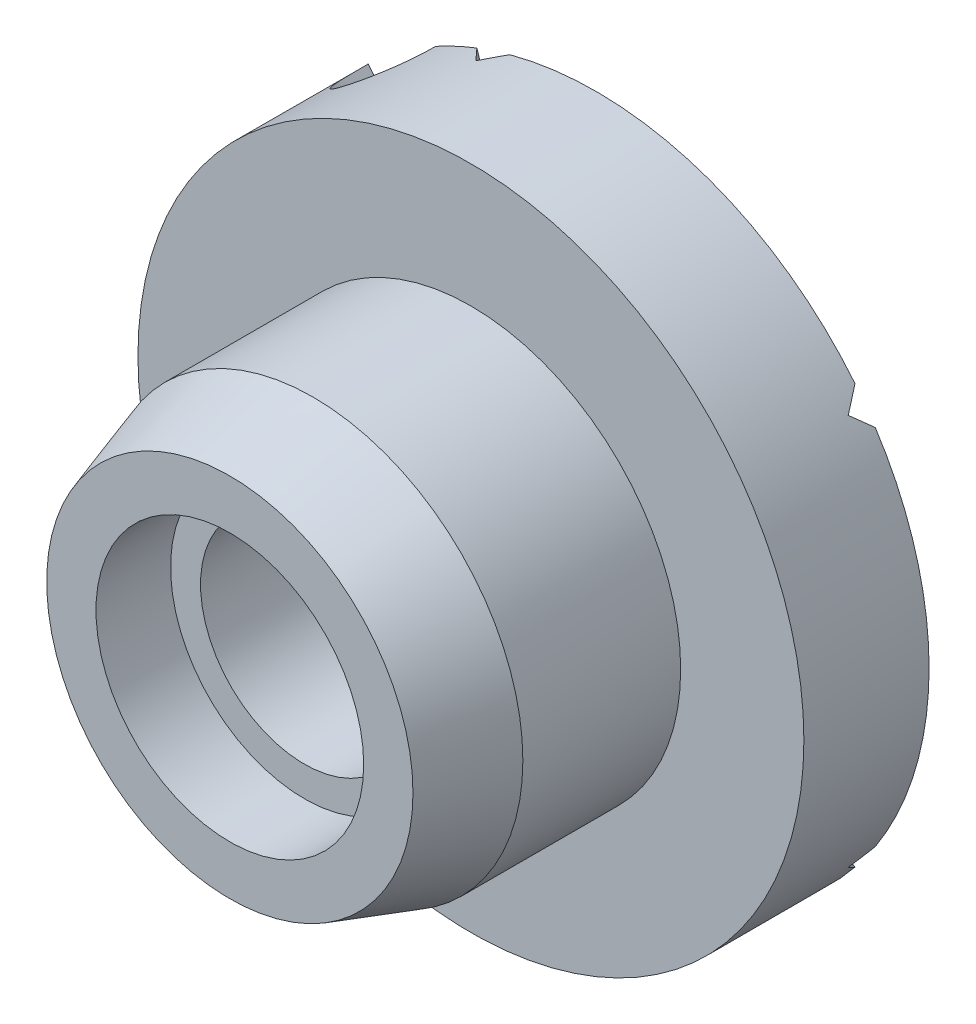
ISO-10303-21;
HEADER;
FILE_DESCRIPTION(('STEP AP214'),'2;1');
FILE_NAME('part.step','',(''),(''),'','','');
FILE_SCHEMA(('AUTOMOTIVE_DESIGN { 1 0 10303 214 1 1 1 1 }'));
ENDSEC;
DATA;
#1=APPLICATION_CONTEXT('core data for automotive mechanical design processes');
#2=APPLICATION_PROTOCOL_DEFINITION('international standard','automotive_design',2000,#1);
#3=PRODUCT_CONTEXT('',#1,'mechanical');
#4=PRODUCT('Part','Part','',(#3));
#5=PRODUCT_RELATED_PRODUCT_CATEGORY('part','',(#4));
#6=PRODUCT_DEFINITION_FORMATION('','',#4);
#7=PRODUCT_DEFINITION_CONTEXT('part definition',#1,'design');
#8=PRODUCT_DEFINITION('design','',#6,#7);
#9=PRODUCT_DEFINITION_SHAPE('','',#8);
#10=(LENGTH_UNIT() NAMED_UNIT(*) SI_UNIT(.MILLI.,.METRE.));
#11=(NAMED_UNIT(*) PLANE_ANGLE_UNIT() SI_UNIT($,.RADIAN.));
#12=(NAMED_UNIT(*) SI_UNIT($,.STERADIAN.) SOLID_ANGLE_UNIT());
#13=UNCERTAINTY_MEASURE_WITH_UNIT(LENGTH_MEASURE(1.E-05),#10,'distance_accuracy_value','');
#14=(GEOMETRIC_REPRESENTATION_CONTEXT(3) GLOBAL_UNCERTAINTY_ASSIGNED_CONTEXT((#13)) GLOBAL_UNIT_ASSIGNED_CONTEXT((#10,
#11,#12)) REPRESENTATION_CONTEXT('',''));
#15=CARTESIAN_POINT('',(0.,0.,0.));
#16=DIRECTION('',(0.,0.,1.));
#17=DIRECTION('',(1.,0.,0.));
#18=AXIS2_PLACEMENT_3D('',#15,#16,#17);
#19=CARTESIAN_POINT('',(0.,0.,0.));
#20=DIRECTION('',(0.,0.,1.));
#21=DIRECTION('',(1.,0.,0.));
#22=AXIS2_PLACEMENT_3D('',#19,#20,#21);
#23=CYLINDRICAL_SURFACE('',#22,6.35);
#24=CARTESIAN_POINT('',(0.,0.,-4.5974));
#25=DIRECTION('',(0.,0.,1.));
#26=DIRECTION('',(1.,0.,0.));
#27=AXIS2_PLACEMENT_3D('',#24,#25,#26);
#28=CIRCLE('',#27,6.35);
#29=CARTESIAN_POINT('',(6.35,0.,-4.5974));
#30=VERTEX_POINT('',#29);
#31=EDGE_CURVE('E172',#30,#30,#28,.T.);
#32=ORIENTED_EDGE('',*,*,#31,.F.);
#33=EDGE_LOOP('',(#32));
#34=FACE_BOUND('',#33,.T.);
#35=CARTESIAN_POINT('',(-4.34524158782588,4.63048329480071,-6.985));
#36=CARTESIAN_POINT('',(-4.34561049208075,4.63013241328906,-6.94031767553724));
#37=CARTESIAN_POINT('',(-4.34460667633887,4.63107891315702,-6.89561854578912));
#38=CARTESIAN_POINT('',(-4.33987519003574,4.63551564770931,-6.80645726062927));
#39=CARTESIAN_POINT('',(-4.33614547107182,4.63900779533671,-6.76199530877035));
#40=CARTESIAN_POINT('',(-4.32593414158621,4.64853099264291,-6.67321992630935));
#41=CARTESIAN_POINT('',(-4.31942626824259,4.65458626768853,-6.62891208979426));
#42=CARTESIAN_POINT('',(-4.30360444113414,4.66921882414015,-6.54124609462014));
#43=CARTESIAN_POINT('',(-4.29429165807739,4.67779505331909,-6.4978875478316));
#44=CARTESIAN_POINT('',(-4.26760510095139,4.70218243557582,-6.39210613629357));
#45=CARTESIAN_POINT('',(-4.24850473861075,4.719493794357,-6.33044338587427));
#46=CARTESIAN_POINT('',(-4.20330863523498,4.75979155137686,-6.21183757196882));
#47=CARTESIAN_POINT('',(-4.17723721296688,4.78275819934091,-6.15487898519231));
#48=CARTESIAN_POINT('',(-4.12698226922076,4.82609791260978,-6.06585877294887));
#49=CARTESIAN_POINT('',(-4.10499635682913,4.84484101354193,-6.03176860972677));
#50=CARTESIAN_POINT('',(-4.05707552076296,4.88503990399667,-5.96824730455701));
#51=CARTESIAN_POINT('',(-4.03114610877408,4.90649190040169,-5.93880977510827));
#52=CARTESIAN_POINT('',(-3.98164312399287,4.94669433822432,-5.89249163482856));
#53=CARTESIAN_POINT('',(-3.95890356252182,4.96492819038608,-5.87428061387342));
#54=CARTESIAN_POINT('',(-3.91113141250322,5.0026467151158,-5.84278722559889));
#55=CARTESIAN_POINT('',(-3.88610056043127,5.02213043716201,-5.82950116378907));
#56=CARTESIAN_POINT('',(-3.83394850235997,5.06205730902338,-5.80883337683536));
#57=CARTESIAN_POINT('',(-3.80680965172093,5.0825078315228,-5.80150911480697));
#58=CARTESIAN_POINT('',(-3.75157370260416,5.12341403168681,-5.79376891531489));
#59=CARTESIAN_POINT('',(-3.7234774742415,5.14386968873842,-5.79334686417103));
#60=CARTESIAN_POINT('',(-3.67153042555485,5.18104587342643,-5.79899179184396));
#61=CARTESIAN_POINT('',(-3.64765273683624,5.19787904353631,-5.80413002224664));
#62=CARTESIAN_POINT('',(-3.60067648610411,5.2305303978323,-5.81905354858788));
#63=CARTESIAN_POINT('',(-3.57757828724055,5.24634811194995,-5.82884097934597));
#64=CARTESIAN_POINT('',(-3.52613850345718,5.28110502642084,-5.85583521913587));
#65=CARTESIAN_POINT('',(-3.49821227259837,5.29962410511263,-5.87436909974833));
#66=CARTESIAN_POINT('',(-3.4449787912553,5.3343825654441,-5.91659717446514));
#67=CARTESIAN_POINT('',(-3.41967633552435,5.35061779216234,-5.94030057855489));
#68=CARTESIAN_POINT('',(-3.36167579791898,5.38732481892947,-6.00248879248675));
#69=CARTESIAN_POINT('',(-3.33041102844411,5.40666047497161,-6.04297191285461));
#70=CARTESIAN_POINT('',(-3.27337538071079,5.44138105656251,-6.12914654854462));
#71=CARTESIAN_POINT('',(-3.24761679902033,5.45675715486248,-6.17484937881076));
#72=CARTESIAN_POINT('',(-3.19092738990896,5.49017400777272,-6.2909787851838));
#73=CARTESIAN_POINT('',(-3.1628298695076,5.50633450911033,-6.36332639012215));
#74=CARTESIAN_POINT('',(-3.11679735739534,5.53251877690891,-6.5121954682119));
#75=CARTESIAN_POINT('',(-3.09887147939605,5.54253704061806,-6.58872061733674));
#76=CARTESIAN_POINT('',(-3.07715658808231,5.55461130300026,-6.7189036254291));
#77=CARTESIAN_POINT('',(-3.07067429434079,5.5581923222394,-6.77199198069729));
#78=CARTESIAN_POINT('',(-3.06239231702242,5.56275611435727,-6.87839169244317));
#79=CARTESIAN_POINT('',(-3.06057078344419,5.56375101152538,-6.93170083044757));
#80=CARTESIAN_POINT('',(-3.06109781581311,5.56346835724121,-6.985));
#81=B_SPLINE_CURVE_WITH_KNOTS('',3,(#35,#36,#37,#38,#39,#40,#41,#42,#43,#44,#45,#46,#47,#48,#49,
#50,#51,#52,#53,#54,#55,#56,#57,#58,#59,#60,#61,#62,#63,#64,#65,#66,#67,#68,#69,#70,#71,#72,#73,
#74,#75,#76,#77,#78,#79,#80),.UNSPECIFIED.,.F.,.F.,(4,2,2,2,2,2,2,2,2,2,2,2,2,2,2,2,2,2,2,2,2,2,
4),(0.,0.134008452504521,0.268117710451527,0.403523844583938,0.53887354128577,0.738714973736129,
0.937868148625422,1.07154257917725,1.20503186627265,1.3077602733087,1.41041146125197,
1.514040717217,1.61757817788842,1.70615616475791,1.79477486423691,1.90902084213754,
2.023472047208,2.18661523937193,2.35011904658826,2.58669535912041,2.82348330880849,
2.98404044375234,3.14384348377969),.UNSPECIFIED.);
#82=CARTESIAN_POINT('',(-4.34524158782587,4.63048329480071,-6.985));
#83=VERTEX_POINT('',#82);
#84=CARTESIAN_POINT('',(-3.06109781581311,5.56346835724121,-6.985));
#85=VERTEX_POINT('',#84);
#86=EDGE_CURVE('E48',#83,#85,#81,.T.);
#87=ORIENTED_EDGE('',*,*,#86,.F.);
#88=CARTESIAN_POINT('',(0.,0.,-6.985));
#89=DIRECTION('',(0.,0.,1.));
#90=DIRECTION('',(1.,0.,0.));
#91=AXIS2_PLACEMENT_3D('',#88,#89,#90);
#92=CIRCLE('',#91,6.35);
#93=CARTESIAN_POINT('',(-6.34140898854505,0.330199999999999,-6.985));
#94=VERTEX_POINT('',#93);
#95=EDGE_CURVE('E152',#83,#94,#92,.T.);
#96=ORIENTED_EDGE('',*,*,#95,.T.);
#97=CARTESIAN_POINT('',(0.,0.,-6.6548));
#98=DIRECTION('',(0.,0.707106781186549,0.707106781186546));
#99=DIRECTION('',(0.,-0.707106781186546,0.707106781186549));
#100=AXIS2_PLACEMENT_3D('',#97,#98,#99);
#101=ELLIPSE('',#100,8.98025612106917,6.35);
#102=CARTESIAN_POINT('',(-6.35,0.,-6.6548));
#103=VERTEX_POINT('',#102);
#104=EDGE_CURVE('E251',#94,#103,#101,.T.);
#105=ORIENTED_EDGE('',*,*,#104,.T.);
#106=CARTESIAN_POINT('',(0.,0.,-6.6548));
#107=DIRECTION('',(0.,-0.707106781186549,0.707106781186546));
#108=DIRECTION('',(0.,0.707106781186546,0.707106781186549));
#109=AXIS2_PLACEMENT_3D('',#106,#107,#108);
#110=ELLIPSE('',#109,8.98025612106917,6.35);
#111=CARTESIAN_POINT('',(-6.34140898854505,-0.330199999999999,-6.985));
#112=VERTEX_POINT('',#111);
#113=EDGE_CURVE('E243',#103,#112,#110,.T.);
#114=ORIENTED_EDGE('',*,*,#113,.T.);
#115=CARTESIAN_POINT('',(-2.27364200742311,-5.92900092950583,-6.985));
#116=VERTEX_POINT('',#115);
#117=EDGE_CURVE('E164',#112,#116,#92,.T.);
#118=ORIENTED_EDGE('',*,*,#117,.T.);
#119=CARTESIAN_POINT('',(0.,0.,-6.6548));
#120=DIRECTION('',(-0.672498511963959,0.218508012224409,0.707106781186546));
#121=DIRECTION('',(0.672498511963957,-0.218508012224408,0.707106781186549));
#122=AXIS2_PLACEMENT_3D('',#119,#120,#121);
#123=ELLIPSE('',#122,8.98025612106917,6.35);
#124=CARTESIAN_POINT('',(-1.9622579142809,-6.03920887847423,-6.6548));
#125=VERTEX_POINT('',#124);
#126=EDGE_CURVE('E233',#116,#125,#123,.T.);
#127=ORIENTED_EDGE('',*,*,#126,.T.);
#128=CARTESIAN_POINT('',(0.,0.,-6.6548));
#129=DIRECTION('',(0.672498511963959,-0.218508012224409,0.707106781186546));
#130=DIRECTION('',(-0.672498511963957,0.218508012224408,0.707106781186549));
#131=AXIS2_PLACEMENT_3D('',#128,#129,#130);
#132=ELLIPSE('',#131,8.98025612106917,6.35);
#133=CARTESIAN_POINT('',(-1.64556428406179,-6.13307575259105,-6.985));
#134=VERTEX_POINT('',#133);
#135=EDGE_CURVE('E270',#125,#134,#132,.T.);
#136=ORIENTED_EDGE('',*,*,#135,.T.);
#137=CARTESIAN_POINT('',(4.93622094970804,-3.99452409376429,-6.985));
#138=VERTEX_POINT('',#137);
#139=EDGE_CURVE('E173',#134,#138,#92,.T.);
#140=ORIENTED_EDGE('',*,*,#139,.T.);
#141=CARTESIAN_POINT('',(0.,0.,-6.6548));
#142=DIRECTION('',(-0.415626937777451,-0.572061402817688,0.707106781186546));
#143=DIRECTION('',(0.41562693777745,0.572061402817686,0.707106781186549));
#144=AXIS2_PLACEMENT_3D('',#141,#142,#143);
#145=ELLIPSE('',#144,8.98025612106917,6.35);
#146=CARTESIAN_POINT('',(5.13725791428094,-3.73243635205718,-6.6548));
#147=VERTEX_POINT('',#146);
#148=EDGE_CURVE('E271',#138,#147,#145,.T.);
#149=ORIENTED_EDGE('',*,*,#148,.T.);
#150=CARTESIAN_POINT('',(0.,0.,-6.6548));
#151=DIRECTION('',(0.415626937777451,0.572061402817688,0.707106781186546));
#152=DIRECTION('',(-0.41562693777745,-0.572061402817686,0.707106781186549));
#153=AXIS2_PLACEMENT_3D('',#150,#151,#152);
#154=ELLIPSE('',#153,8.98025612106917,6.35);
#155=CARTESIAN_POINT('',(5.32439433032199,-3.46024927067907,-6.985));
#156=VERTEX_POINT('',#155);
#157=EDGE_CURVE('E277',#147,#156,#154,.T.);
#158=ORIENTED_EDGE('',*,*,#157,.T.);
#159=CARTESIAN_POINT('',(5.32439433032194,3.46024927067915,-6.985));
#160=VERTEX_POINT('',#159);
#161=EDGE_CURVE('E180',#156,#160,#92,.T.);
#162=ORIENTED_EDGE('',*,*,#161,.T.);
#163=CARTESIAN_POINT('',(0.,0.,-6.6548));
#164=DIRECTION('',(0.415626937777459,-0.572061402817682,0.707106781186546));
#165=DIRECTION('',(-0.415626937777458,0.57206140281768,0.707106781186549));
#166=AXIS2_PLACEMENT_3D('',#163,#164,#165);
#167=ELLIPSE('',#166,8.98025612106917,6.35);
#168=CARTESIAN_POINT('',(5.13725791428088,3.73243635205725,-6.6548));
#169=VERTEX_POINT('',#168);
#170=EDGE_CURVE('E282',#160,#169,#167,.T.);
#171=ORIENTED_EDGE('',*,*,#170,.T.);
#172=CARTESIAN_POINT('',(0.,0.,-6.6548));
#173=DIRECTION('',(-0.415626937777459,0.572061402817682,0.707106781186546));
#174=DIRECTION('',(0.415626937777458,-0.57206140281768,0.707106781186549));
#175=AXIS2_PLACEMENT_3D('',#172,#173,#174);
#176=ELLIPSE('',#175,8.98025612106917,6.35);
#177=CARTESIAN_POINT('',(4.93622094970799,3.99452409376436,-6.985));
#178=VERTEX_POINT('',#177);
#179=EDGE_CURVE('E193',#169,#178,#176,.T.);
#180=ORIENTED_EDGE('',*,*,#179,.T.);
#181=CARTESIAN_POINT('',(-1.64556428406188,6.13307575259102,-6.985));
#182=VERTEX_POINT('',#181);
#183=EDGE_CURVE('E165',#178,#182,#92,.T.);
#184=ORIENTED_EDGE('',*,*,#183,.T.);
#185=CARTESIAN_POINT('',(0.,0.,-6.6548));
#186=DIRECTION('',(0.672498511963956,0.218508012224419,0.707106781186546));
#187=DIRECTION('',(-0.672498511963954,-0.218508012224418,0.707106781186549));
#188=AXIS2_PLACEMENT_3D('',#185,#186,#187);
#189=ELLIPSE('',#188,8.98025612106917,6.35);
#190=CARTESIAN_POINT('',(-1.96225791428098,6.0392088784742,-6.6548));
#191=VERTEX_POINT('',#190);
#192=EDGE_CURVE('E192',#182,#191,#189,.T.);
#193=ORIENTED_EDGE('',*,*,#192,.T.);
#194=CARTESIAN_POINT('',(0.,0.,-6.6548));
#195=DIRECTION('',(-0.672498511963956,-0.218508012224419,0.707106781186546));
#196=DIRECTION('',(0.672498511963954,0.218508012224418,0.707106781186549));
#197=AXIS2_PLACEMENT_3D('',#194,#195,#196);
#198=ELLIPSE('',#197,8.98025612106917,6.35);
#199=CARTESIAN_POINT('',(-2.27364200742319,5.9290009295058,-6.985));
#200=VERTEX_POINT('',#199);
#201=EDGE_CURVE('E292',#191,#200,#198,.T.);
#202=ORIENTED_EDGE('',*,*,#201,.T.);
#203=EDGE_CURVE('E155',#200,#85,#92,.T.);
#204=ORIENTED_EDGE('',*,*,#203,.T.);
#205=EDGE_LOOP('',(#87,#96,#105,#114,#118,#127,#136,#140,#149,#158,#162,#171,#180,#184,#193,
#202,#204));
#206=FACE_BOUND('',#205,.T.);
#207=ADVANCED_FACE('F35',(#34,#206),#23,.T.);
#208=CARTESIAN_POINT('',(0.,6.35,-6.985));
#209=DIRECTION('',(0.,0.,1.));
#210=DIRECTION('',(1.,0.,0.));
#211=AXIS2_PLACEMENT_3D('',#208,#209,#210);
#212=PLANE('',#211);
#213=CARTESIAN_POINT('',(-3.6924122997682,5.08216953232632,-6.985));
#214=DIRECTION('',(0.,0.,1.));
#215=DIRECTION('',(0.587785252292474,-0.809016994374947,0.));
#216=AXIS2_PLACEMENT_3D('',#213,#214,#215);
#217=ELLIPSE('',#216,1.12253201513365,0.793750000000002);
#218=EDGE_CURVE('E11',#85,#83,#217,.F.);
#219=ORIENTED_EDGE('',*,*,#218,.F.);
#220=ORIENTED_EDGE('',*,*,#203,.F.);
#221=DIRECTION('',(0.309016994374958,-0.95105651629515,0.));
#222=VECTOR('',#221,1.);
#223=CARTESIAN_POINT('',(-2.18025703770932,5.6415915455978,-6.985));
#224=LINE('',#223,#222);
#225=CARTESIAN_POINT('',(-0.917700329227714,1.75584154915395,-6.985));
#226=VERTEX_POINT('',#225);
#227=EDGE_CURVE('E205',#200,#226,#224,.T.);
#228=ORIENTED_EDGE('',*,*,#227,.T.);
#229=CARTESIAN_POINT('',(0.,0.,-6.985));
#230=DIRECTION('',(0.,0.,1.));
#231=DIRECTION('',(1.,0.,0.));
#232=AXIS2_PLACEMENT_3D('',#229,#230,#231);
#233=CIRCLE('',#232,1.9812);
#234=CARTESIAN_POINT('',(-1.95348954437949,0.330199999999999,-6.985));
#235=VERTEX_POINT('',#234);
#236=EDGE_CURVE('E169',#226,#235,#233,.T.);
#237=ORIENTED_EDGE('',*,*,#236,.T.);
#238=DIRECTION('',(-1.,0.,0.));
#239=VECTOR('',#238,1.);
#240=CARTESIAN_POINT('',(0.,0.330199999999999,-6.985));
#241=LINE('',#240,#239);
#242=EDGE_CURVE('E161',#235,#94,#241,.T.);
#243=ORIENTED_EDGE('',*,*,#242,.T.);
#244=ORIENTED_EDGE('',*,*,#95,.F.);
#245=EDGE_LOOP('',(#219,#220,#228,#237,#243,#244));
#246=FACE_BOUND('',#245,.T.);
#247=ADVANCED_FACE('F159',(#246),#212,.F.);
#248=CARTESIAN_POINT('',(-1.95348954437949,-0.330199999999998,-6.985));
#249=VERTEX_POINT('',#248);
#250=CARTESIAN_POINT('',(-0.91770032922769,-1.75584154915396,-6.985));
#251=VERTEX_POINT('',#250);
#252=EDGE_CURVE('E162',#249,#251,#233,.T.);
#253=ORIENTED_EDGE('',*,*,#252,.T.);
#254=DIRECTION('',(-0.309016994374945,-0.951056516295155,0.));
#255=VECTOR('',#254,1.);
#256=CARTESIAN_POINT('',(1.55217931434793,5.84566636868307,-6.985));
#257=LINE('',#256,#255);
#258=EDGE_CURVE('E43',#251,#116,#257,.T.);
#259=ORIENTED_EDGE('',*,*,#258,.T.);
#260=ORIENTED_EDGE('',*,*,#117,.F.);
#261=DIRECTION('',(1.,0.,0.));
#262=VECTOR('',#261,1.);
#263=CARTESIAN_POINT('',(0.,-0.330199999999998,-6.985));
#264=LINE('',#263,#262);
#265=EDGE_CURVE('E525',#112,#249,#264,.T.);
#266=ORIENTED_EDGE('',*,*,#265,.T.);
#267=EDGE_LOOP('',(#253,#259,#260,#266));
#268=FACE_BOUND('',#267,.T.);
#269=ADVANCED_FACE('F224',(#268),#212,.F.);
#270=ORIENTED_EDGE('',*,*,#139,.F.);
#271=DIRECTION('',(0.309016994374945,0.951056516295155,0.));
#272=VECTOR('',#271,1.);
#273=CARTESIAN_POINT('',(2.18025703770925,5.64159154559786,-6.985));
#274=LINE('',#273,#272);
#275=CARTESIAN_POINT('',(-0.289622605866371,-1.95991637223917,-6.985));
#276=VERTEX_POINT('',#275);
#277=EDGE_CURVE('E220',#134,#276,#274,.T.);
#278=ORIENTED_EDGE('',*,*,#277,.T.);
#279=CARTESIAN_POINT('',(1.38631954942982,-1.41536975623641,-6.985));
#280=VERTEX_POINT('',#279);
#281=EDGE_CURVE('E167',#276,#280,#233,.T.);
#282=ORIENTED_EDGE('',*,*,#281,.T.);
#283=DIRECTION('',(0.809016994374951,-0.587785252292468,0.));
#284=VECTOR('',#283,1.);
#285=CARTESIAN_POINT('',(-3.21369112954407,1.9267336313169,-6.985));
#286=LINE('',#285,#284);
#287=EDGE_CURVE('E217',#280,#138,#286,.T.);
#288=ORIENTED_EDGE('',*,*,#287,.T.);
#289=EDGE_LOOP('',(#270,#278,#282,#288));
#290=FACE_BOUND('',#289,.T.);
#291=ADVANCED_FACE('F262',(#290),#212,.F.);
#292=ORIENTED_EDGE('',*,*,#161,.F.);
#293=DIRECTION('',(-0.809016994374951,0.587785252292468,0.));
#294=VECTOR('',#293,1.);
#295=CARTESIAN_POINT('',(-2.82551774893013,2.46100845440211,-6.985));
#296=LINE('',#295,#294);
#297=CARTESIAN_POINT('',(1.77449293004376,-0.881094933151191,-6.985));
#298=VERTEX_POINT('',#297);
#299=EDGE_CURVE('E214',#156,#298,#296,.T.);
#300=ORIENTED_EDGE('',*,*,#299,.T.);
#301=CARTESIAN_POINT('',(1.77449293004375,0.881094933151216,-6.985));
#302=VERTEX_POINT('',#301);
#303=EDGE_CURVE('E256',#298,#302,#233,.T.);
#304=ORIENTED_EDGE('',*,*,#303,.T.);
#305=DIRECTION('',(0.809016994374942,0.58778525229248,0.));
#306=VECTOR('',#305,1.);
#307=CARTESIAN_POINT('',(3.21369112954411,1.92673363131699,-6.985));
#308=LINE('',#307,#306);
#309=EDGE_CURVE('E207',#302,#160,#308,.T.);
#310=ORIENTED_EDGE('',*,*,#309,.T.);
#311=EDGE_LOOP('',(#292,#300,#304,#310));
#312=FACE_BOUND('',#311,.T.);
#313=ADVANCED_FACE('F355',(#312),#212,.F.);
#314=ORIENTED_EDGE('',*,*,#183,.F.);
#315=DIRECTION('',(-0.809016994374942,-0.58778525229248,0.));
#316=VECTOR('',#315,1.);
#317=CARTESIAN_POINT('',(2.82551774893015,2.4610084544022,-6.985));
#318=LINE('',#317,#316);
#319=CARTESIAN_POINT('',(1.3863195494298,1.41536975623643,-6.985));
#320=VERTEX_POINT('',#319);
#321=EDGE_CURVE('E199',#178,#320,#318,.T.);
#322=ORIENTED_EDGE('',*,*,#321,.T.);
#323=CARTESIAN_POINT('',(-0.289622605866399,1.95991637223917,-6.985));
#324=VERTEX_POINT('',#323);
#325=EDGE_CURVE('E202',#320,#324,#233,.T.);
#326=ORIENTED_EDGE('',*,*,#325,.T.);
#327=DIRECTION('',(-0.309016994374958,0.95105651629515,0.));
#328=VECTOR('',#327,1.);
#329=CARTESIAN_POINT('',(-1.552179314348,5.84566636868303,-6.985));
#330=LINE('',#329,#328);
#331=EDGE_CURVE('E201',#324,#182,#330,.T.);
#332=ORIENTED_EDGE('',*,*,#331,.T.);
#333=EDGE_LOOP('',(#314,#322,#326,#332));
#334=FACE_BOUND('',#333,.T.);
#335=ADVANCED_FACE('F197',(#334),#212,.F.);
#336=CARTESIAN_POINT('',(0.,0.,0.));
#337=DIRECTION('',(0.,0.,1.));
#338=DIRECTION('',(1.,0.,0.));
#339=AXIS2_PLACEMENT_3D('',#336,#337,#338);
#340=CYLINDRICAL_SURFACE('',#339,1.9812);
#341=CARTESIAN_POINT('',(0.,0.,-6.6548));
#342=DIRECTION('',(0.672498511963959,-0.218508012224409,0.707106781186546));
#343=DIRECTION('',(-0.672498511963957,0.218508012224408,0.707106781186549));
#344=AXIS2_PLACEMENT_3D('',#341,#342,#343);
#345=ELLIPSE('',#344,2.80183990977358,1.9812);
#346=CARTESIAN_POINT('',(-0.61222446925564,-1.88423317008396,-6.6548));
#347=VERTEX_POINT('',#346);
#348=EDGE_CURVE('E239',#276,#347,#345,.F.);
#349=ORIENTED_EDGE('',*,*,#348,.T.);
#350=CARTESIAN_POINT('',(0.,0.,-6.6548));
#351=DIRECTION('',(-0.672498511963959,0.218508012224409,0.707106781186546));
#352=DIRECTION('',(0.672498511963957,-0.218508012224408,0.707106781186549));
#353=AXIS2_PLACEMENT_3D('',#350,#351,#352);
#354=ELLIPSE('',#353,2.80183990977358,1.9812);
#355=EDGE_CURVE('E231',#347,#251,#354,.F.);
#356=ORIENTED_EDGE('',*,*,#355,.T.);
#357=ORIENTED_EDGE('',*,*,#252,.F.);
#358=CARTESIAN_POINT('',(0.,0.,-6.6548));
#359=DIRECTION('',(0.,-0.707106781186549,0.707106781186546));
#360=DIRECTION('',(0.,0.707106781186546,0.707106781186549));
#361=AXIS2_PLACEMENT_3D('',#358,#359,#360);
#362=ELLIPSE('',#361,2.80183990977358,1.9812);
#363=CARTESIAN_POINT('',(-1.9812,0.,-6.6548));
#364=VERTEX_POINT('',#363);
#365=EDGE_CURVE('E249',#249,#364,#362,.F.);
#366=ORIENTED_EDGE('',*,*,#365,.T.);
#367=CARTESIAN_POINT('',(0.,0.,-6.6548));
#368=DIRECTION('',(0.,0.707106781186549,0.707106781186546));
#369=DIRECTION('',(0.,-0.707106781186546,0.707106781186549));
#370=AXIS2_PLACEMENT_3D('',#367,#368,#369);
#371=ELLIPSE('',#370,2.80183990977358,1.9812);
#372=EDGE_CURVE('E253',#364,#235,#371,.F.);
#373=ORIENTED_EDGE('',*,*,#372,.T.);
#374=ORIENTED_EDGE('',*,*,#236,.F.);
#375=CARTESIAN_POINT('',(0.,0.,-6.6548));
#376=DIRECTION('',(-0.672498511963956,-0.218508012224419,0.707106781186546));
#377=DIRECTION('',(0.672498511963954,0.218508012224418,0.707106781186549));
#378=AXIS2_PLACEMENT_3D('',#375,#376,#377);
#379=ELLIPSE('',#378,2.80183990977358,1.9812);
#380=CARTESIAN_POINT('',(-0.612224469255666,1.88423317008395,-6.6548));
#381=VERTEX_POINT('',#380);
#382=EDGE_CURVE('E56',#226,#381,#379,.F.);
#383=ORIENTED_EDGE('',*,*,#382,.T.);
#384=CARTESIAN_POINT('',(0.,0.,-6.6548));
#385=DIRECTION('',(0.672498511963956,0.218508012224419,0.707106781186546));
#386=DIRECTION('',(-0.672498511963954,-0.218508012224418,0.707106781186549));
#387=AXIS2_PLACEMENT_3D('',#384,#385,#386);
#388=ELLIPSE('',#387,2.80183990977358,1.9812);
#389=EDGE_CURVE('E288',#381,#324,#388,.F.);
#390=ORIENTED_EDGE('',*,*,#389,.T.);
#391=ORIENTED_EDGE('',*,*,#325,.F.);
#392=CARTESIAN_POINT('',(0.,0.,-6.6548));
#393=DIRECTION('',(-0.415626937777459,0.572061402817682,0.707106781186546));
#394=DIRECTION('',(0.415626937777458,-0.57206140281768,0.707106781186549));
#395=AXIS2_PLACEMENT_3D('',#392,#393,#394);
#396=ELLIPSE('',#395,2.80183990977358,1.9812);
#397=CARTESIAN_POINT('',(1.60282446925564,1.16452014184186,-6.6548));
#398=VERTEX_POINT('',#397);
#399=EDGE_CURVE('E284',#320,#398,#396,.F.);
#400=ORIENTED_EDGE('',*,*,#399,.T.);
#401=CARTESIAN_POINT('',(0.,0.,-6.6548));
#402=DIRECTION('',(0.415626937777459,-0.572061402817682,0.707106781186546));
#403=DIRECTION('',(-0.415626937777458,0.57206140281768,0.707106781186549));
#404=AXIS2_PLACEMENT_3D('',#401,#402,#403);
#405=ELLIPSE('',#404,2.80183990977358,1.9812);
#406=EDGE_CURVE('E279',#398,#302,#405,.F.);
#407=ORIENTED_EDGE('',*,*,#406,.T.);
#408=ORIENTED_EDGE('',*,*,#303,.F.);
#409=CARTESIAN_POINT('',(0.,0.,-6.6548));
#410=DIRECTION('',(0.415626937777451,0.572061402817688,0.707106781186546));
#411=DIRECTION('',(-0.41562693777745,-0.572061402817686,0.707106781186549));
#412=AXIS2_PLACEMENT_3D('',#409,#410,#411);
#413=ELLIPSE('',#412,2.80183990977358,1.9812);
#414=CARTESIAN_POINT('',(1.60282446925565,-1.16452014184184,-6.6548));
#415=VERTEX_POINT('',#414);
#416=EDGE_CURVE('E266',#298,#415,#413,.F.);
#417=ORIENTED_EDGE('',*,*,#416,.T.);
#418=CARTESIAN_POINT('',(0.,0.,-6.6548));
#419=DIRECTION('',(-0.415626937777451,-0.572061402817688,0.707106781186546));
#420=DIRECTION('',(0.41562693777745,0.572061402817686,0.707106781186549));
#421=AXIS2_PLACEMENT_3D('',#418,#419,#420);
#422=ELLIPSE('',#421,2.80183990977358,1.9812);
#423=EDGE_CURVE('E265',#415,#280,#422,.F.);
#424=ORIENTED_EDGE('',*,*,#423,.T.);
#425=ORIENTED_EDGE('',*,*,#281,.F.);
#426=EDGE_LOOP('',(#349,#356,#357,#366,#373,#374,#383,#390,#391,#400,#407,#408,#417,#424,#425));
#427=FACE_BOUND('',#426,.T.);
#428=CARTESIAN_POINT('',(0.,0.,-1.4224));
#429=DIRECTION('',(0.,0.,1.));
#430=DIRECTION('',(1.,0.,0.));
#431=AXIS2_PLACEMENT_3D('',#428,#429,#430);
#432=CIRCLE('',#431,1.9812);
#433=CARTESIAN_POINT('',(1.9812,0.,-1.4224));
#434=VERTEX_POINT('',#433);
#435=EDGE_CURVE('E519',#434,#434,#432,.T.);
#436=ORIENTED_EDGE('',*,*,#435,.T.);
#437=EDGE_LOOP('',(#436));
#438=FACE_BOUND('',#437,.T.);
#439=ADVANCED_FACE('F37',(#427,#438),#340,.F.);
#440=CARTESIAN_POINT('',(0.,1.9812,-1.4224));
#441=DIRECTION('',(0.,0.,-1.));
#442=DIRECTION('',(-1.,0.,0.));
#443=AXIS2_PLACEMENT_3D('',#440,#441,#442);
#444=PLANE('',#443);
#445=ORIENTED_EDGE('',*,*,#435,.F.);
#446=EDGE_LOOP('',(#445));
#447=FACE_BOUND('',#446,.T.);
#448=CARTESIAN_POINT('',(0.,0.,-1.4224));
#449=DIRECTION('',(0.,0.,1.));
#450=DIRECTION('',(1.,0.,0.));
#451=AXIS2_PLACEMENT_3D('',#448,#449,#450);
#452=CIRCLE('',#451,2.5527);
#453=CARTESIAN_POINT('',(2.5527,0.,-1.4224));
#454=VERTEX_POINT('',#453);
#455=EDGE_CURVE('E522',#454,#454,#452,.T.);
#456=ORIENTED_EDGE('',*,*,#455,.T.);
#457=EDGE_LOOP('',(#456));
#458=FACE_BOUND('',#457,.T.);
#459=ADVANCED_FACE('F360',(#447,#458),#444,.F.);
#460=CARTESIAN_POINT('',(0.,0.,0.));
#461=DIRECTION('',(0.,0.,1.));
#462=DIRECTION('',(1.,0.,0.));
#463=AXIS2_PLACEMENT_3D('',#460,#461,#462);
#464=CYLINDRICAL_SURFACE('',#463,2.5527);
#465=ORIENTED_EDGE('',*,*,#455,.F.);
#466=EDGE_LOOP('',(#465));
#467=FACE_BOUND('',#466,.T.);
#468=CARTESIAN_POINT('',(0.,0.,0.));
#469=DIRECTION('',(0.,0.,1.));
#470=DIRECTION('',(1.,0.,0.));
#471=AXIS2_PLACEMENT_3D('',#468,#469,#470);
#472=CIRCLE('',#471,2.5527);
#473=CARTESIAN_POINT('',(2.5527,0.,0.));
#474=VERTEX_POINT('',#473);
#475=EDGE_CURVE('E523',#474,#474,#472,.T.);
#476=ORIENTED_EDGE('',*,*,#475,.T.);
#477=EDGE_LOOP('',(#476));
#478=FACE_BOUND('',#477,.T.);
#479=ADVANCED_FACE('F425',(#467,#478),#464,.F.);
#480=CARTESIAN_POINT('',(0.,2.5527,0.));
#481=DIRECTION('',(0.,0.,-1.));
#482=DIRECTION('',(-1.,0.,0.));
#483=AXIS2_PLACEMENT_3D('',#480,#481,#482);
#484=PLANE('',#483);
#485=ORIENTED_EDGE('',*,*,#475,.F.);
#486=EDGE_LOOP('',(#485));
#487=FACE_BOUND('',#486,.T.);
#488=CARTESIAN_POINT('',(0.,0.,0.));
#489=DIRECTION('',(0.,0.,1.));
#490=DIRECTION('',(1.,0.,0.));
#491=AXIS2_PLACEMENT_3D('',#488,#489,#490);
#492=CIRCLE('',#491,3.4925);
#493=CARTESIAN_POINT('',(3.4925,0.,0.));
#494=VERTEX_POINT('',#493);
#495=EDGE_CURVE('E528',#494,#494,#492,.T.);
#496=ORIENTED_EDGE('',*,*,#495,.T.);
#497=EDGE_LOOP('',(#496));
#498=FACE_BOUND('',#497,.T.);
#499=ADVANCED_FACE('F415',(#487,#498),#484,.F.);
#500=CARTESIAN_POINT('',(0.,0.,-1.5875));
#501=DIRECTION('',(0.,0.,-1.));
#502=DIRECTION('',(-1.,0.,0.));
#503=AXIS2_PLACEMENT_3D('',#500,#501,#502);
#504=CONICAL_SURFACE('',#503,4.0005,0.309702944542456);
#505=ORIENTED_EDGE('',*,*,#495,.F.);
#506=EDGE_LOOP('',(#505));
#507=FACE_BOUND('',#506,.T.);
#508=CARTESIAN_POINT('',(0.,0.,-1.5875));
#509=DIRECTION('',(0.,0.,1.));
#510=DIRECTION('',(1.,0.,0.));
#511=AXIS2_PLACEMENT_3D('',#508,#509,#510);
#512=CIRCLE('',#511,4.0005);
#513=CARTESIAN_POINT('',(4.0005,0.,-1.5875));
#514=VERTEX_POINT('',#513);
#515=EDGE_CURVE('E535',#514,#514,#512,.T.);
#516=ORIENTED_EDGE('',*,*,#515,.T.);
#517=EDGE_LOOP('',(#516));
#518=FACE_BOUND('',#517,.T.);
#519=ADVANCED_FACE('F405',(#507,#518),#504,.T.);
#520=CARTESIAN_POINT('',(0.,0.,0.));
#521=DIRECTION('',(0.,0.,1.));
#522=DIRECTION('',(1.,0.,0.));
#523=AXIS2_PLACEMENT_3D('',#520,#521,#522);
#524=CYLINDRICAL_SURFACE('',#523,4.0005);
#525=ORIENTED_EDGE('',*,*,#515,.F.);
#526=EDGE_LOOP('',(#525));
#527=FACE_BOUND('',#526,.T.);
#528=CARTESIAN_POINT('',(0.,0.,-4.5974));
#529=DIRECTION('',(0.,0.,1.));
#530=DIRECTION('',(1.,0.,0.));
#531=AXIS2_PLACEMENT_3D('',#528,#529,#530);
#532=CIRCLE('',#531,4.0005);
#533=CARTESIAN_POINT('',(4.0005,0.,-4.5974));
#534=VERTEX_POINT('',#533);
#535=EDGE_CURVE('E178',#534,#534,#532,.T.);
#536=ORIENTED_EDGE('',*,*,#535,.T.);
#537=EDGE_LOOP('',(#536));
#538=FACE_BOUND('',#537,.T.);
#539=ADVANCED_FACE('F395',(#527,#538),#524,.T.);
#540=CARTESIAN_POINT('',(0.,4.0005,-4.5974));
#541=DIRECTION('',(0.,0.,-1.));
#542=DIRECTION('',(-1.,0.,0.));
#543=AXIS2_PLACEMENT_3D('',#540,#541,#542);
#544=PLANE('',#543);
#545=ORIENTED_EDGE('',*,*,#535,.F.);
#546=EDGE_LOOP('',(#545));
#547=FACE_BOUND('',#546,.T.);
#548=ORIENTED_EDGE('',*,*,#31,.T.);
#549=EDGE_LOOP('',(#548));
#550=FACE_BOUND('',#549,.T.);
#551=ADVANCED_FACE('F345',(#547,#550),#544,.F.);
#552=CARTESIAN_POINT('',(-7.62,0.,-6.6548));
#553=DIRECTION('',(0.,0.707106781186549,0.707106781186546));
#554=DIRECTION('',(0.,-0.707106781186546,0.707106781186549));
#555=AXIS2_PLACEMENT_3D('',#552,#553,#554);
#556=PLANE('',#555);
#557=DIRECTION('',(1.,0.,0.));
#558=VECTOR('',#557,1.);
#559=CARTESIAN_POINT('',(-7.62,0.,-6.6548));
#560=LINE('',#559,#558);
#561=EDGE_CURVE('E240',#103,#364,#560,.T.);
#562=ORIENTED_EDGE('',*,*,#561,.F.);
#563=ORIENTED_EDGE('',*,*,#104,.F.);
#564=ORIENTED_EDGE('',*,*,#242,.F.);
#565=ORIENTED_EDGE('',*,*,#372,.F.);
#566=EDGE_LOOP('',(#562,#563,#564,#565));
#567=FACE_BOUND('',#566,.T.);
#568=ADVANCED_FACE('F342',(#567),#556,.F.);
#569=CARTESIAN_POINT('',(-7.62,-0.330199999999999,-6.985));
#570=DIRECTION('',(0.,-0.707106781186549,0.707106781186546));
#571=DIRECTION('',(0.,-0.707106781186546,-0.707106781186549));
#572=AXIS2_PLACEMENT_3D('',#569,#570,#571);
#573=PLANE('',#572);
#574=ORIENTED_EDGE('',*,*,#265,.F.);
#575=ORIENTED_EDGE('',*,*,#113,.F.);
#576=ORIENTED_EDGE('',*,*,#561,.T.);
#577=ORIENTED_EDGE('',*,*,#365,.F.);
#578=EDGE_LOOP('',(#574,#575,#576,#577));
#579=FACE_BOUND('',#578,.T.);
#580=ADVANCED_FACE('F317',(#579),#573,.F.);
#581=CARTESIAN_POINT('',(-2.66874835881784,7.14501324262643,-6.985));
#582=DIRECTION('',(-0.672498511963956,-0.218508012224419,0.707106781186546));
#583=DIRECTION('',(0.724617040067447,0.,0.689151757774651));
#584=AXIS2_PLACEMENT_3D('',#581,#582,#583);
#585=PLANE('',#584);
#586=ORIENTED_EDGE('',*,*,#227,.F.);
#587=ORIENTED_EDGE('',*,*,#201,.F.);
#588=DIRECTION('',(0.309016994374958,-0.95105651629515,0.));
#589=VECTOR('',#588,1.);
#590=CARTESIAN_POINT('',(-2.35470949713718,7.24705065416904,-6.6548));
#591=LINE('',#590,#589);
#592=EDGE_CURVE('E156',#191,#381,#591,.T.);
#593=ORIENTED_EDGE('',*,*,#592,.T.);
#594=ORIENTED_EDGE('',*,*,#382,.F.);
#595=EDGE_LOOP('',(#586,#587,#593,#594));
#596=FACE_BOUND('',#595,.T.);
#597=ADVANCED_FACE('F313',(#596),#585,.F.);
#598=CARTESIAN_POINT('',(-2.35470949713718,7.24705065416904,-6.6548));
#599=DIRECTION('',(0.672498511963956,0.218508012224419,0.707106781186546));
#600=DIRECTION('',(0.724617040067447,0.,-0.689151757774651));
#601=AXIS2_PLACEMENT_3D('',#598,#599,#600);
#602=PLANE('',#601);
#603=ORIENTED_EDGE('',*,*,#592,.F.);
#604=ORIENTED_EDGE('',*,*,#192,.F.);
#605=ORIENTED_EDGE('',*,*,#331,.F.);
#606=ORIENTED_EDGE('',*,*,#389,.F.);
#607=EDGE_LOOP('',(#603,#604,#605,#606));
#608=FACE_BOUND('',#607,.T.);
#609=ADVANCED_FACE('F316',(#608),#602,.F.);
#610=CARTESIAN_POINT('',(5.97062280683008,4.7460610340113,-6.985));
#611=DIRECTION('',(-0.415626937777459,0.572061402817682,0.707106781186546));
#612=DIRECTION('',(0.,-0.777437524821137,0.628960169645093));
#613=AXIS2_PLACEMENT_3D('',#610,#611,#612);
#614=PLANE('',#613);
#615=ORIENTED_EDGE('',*,*,#321,.F.);
#616=ORIENTED_EDGE('',*,*,#179,.F.);
#617=DIRECTION('',(-0.809016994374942,-0.58778525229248,0.));
#618=VECTOR('',#617,1.);
#619=CARTESIAN_POINT('',(6.16470949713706,4.4789236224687,-6.6548));
#620=LINE('',#619,#618);
#621=EDGE_CURVE('E298',#169,#398,#620,.T.);
#622=ORIENTED_EDGE('',*,*,#621,.T.);
#623=ORIENTED_EDGE('',*,*,#399,.F.);
#624=EDGE_LOOP('',(#615,#616,#622,#623));
#625=FACE_BOUND('',#624,.T.);
#626=ADVANCED_FACE('F320',(#625),#614,.F.);
#627=CARTESIAN_POINT('',(6.16470949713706,4.4789236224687,-6.6548));
#628=DIRECTION('',(0.415626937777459,-0.572061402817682,0.707106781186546));
#629=DIRECTION('',(0.,-0.777437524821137,-0.628960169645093));
#630=AXIS2_PLACEMENT_3D('',#627,#628,#629);
#631=PLANE('',#630);
#632=ORIENTED_EDGE('',*,*,#621,.F.);
#633=ORIENTED_EDGE('',*,*,#170,.F.);
#634=ORIENTED_EDGE('',*,*,#309,.F.);
#635=ORIENTED_EDGE('',*,*,#406,.F.);
#636=EDGE_LOOP('',(#632,#633,#634,#635));
#637=FACE_BOUND('',#636,.T.);
#638=ADVANCED_FACE('F323',(#637),#631,.F.);
#639=CARTESIAN_POINT('',(6.3587961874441,-4.211786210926,-6.985));
#640=DIRECTION('',(0.415626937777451,0.572061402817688,0.707106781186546));
#641=DIRECTION('',(0.,-0.777437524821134,0.628960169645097));
#642=AXIS2_PLACEMENT_3D('',#639,#640,#641);
#643=PLANE('',#642);
#644=ORIENTED_EDGE('',*,*,#299,.F.);
#645=ORIENTED_EDGE('',*,*,#157,.F.);
#646=DIRECTION('',(-0.809016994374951,0.587785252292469,0.));
#647=VECTOR('',#646,1.);
#648=CARTESIAN_POINT('',(6.16470949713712,-4.47892362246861,-6.6548));
#649=LINE('',#648,#647);
#650=EDGE_CURVE('E296',#147,#415,#649,.T.);
#651=ORIENTED_EDGE('',*,*,#650,.T.);
#652=ORIENTED_EDGE('',*,*,#416,.F.);
#653=EDGE_LOOP('',(#644,#645,#651,#652));
#654=FACE_BOUND('',#653,.T.);
#655=ADVANCED_FACE('F327',(#654),#643,.F.);
#656=CARTESIAN_POINT('',(6.16470949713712,-4.47892362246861,-6.6548));
#657=DIRECTION('',(-0.415626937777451,-0.572061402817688,0.707106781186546));
#658=DIRECTION('',(0.,-0.777437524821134,-0.628960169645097));
#659=AXIS2_PLACEMENT_3D('',#656,#657,#658);
#660=PLANE('',#659);
#661=ORIENTED_EDGE('',*,*,#650,.F.);
#662=ORIENTED_EDGE('',*,*,#148,.F.);
#663=ORIENTED_EDGE('',*,*,#287,.F.);
#664=ORIENTED_EDGE('',*,*,#423,.F.);
#665=EDGE_LOOP('',(#661,#662,#663,#664));
#666=FACE_BOUND('',#665,.T.);
#667=ADVANCED_FACE('F331',(#666),#660,.F.);
#668=CARTESIAN_POINT('',(-2.35470949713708,-7.24705065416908,-6.6548));
#669=DIRECTION('',(-0.672498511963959,0.218508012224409,0.707106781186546));
#670=DIRECTION('',(0.724617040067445,0.,0.689151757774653));
#671=AXIS2_PLACEMENT_3D('',#668,#669,#670);
#672=PLANE('',#671);
#673=DIRECTION('',(0.309016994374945,0.951056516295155,0.));
#674=VECTOR('',#673,1.);
#675=CARTESIAN_POINT('',(-2.35470949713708,-7.24705065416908,-6.6548));
#676=LINE('',#675,#674);
#677=EDGE_CURVE('E294',#125,#347,#676,.T.);
#678=ORIENTED_EDGE('',*,*,#677,.F.);
#679=ORIENTED_EDGE('',*,*,#126,.F.);
#680=ORIENTED_EDGE('',*,*,#258,.F.);
#681=ORIENTED_EDGE('',*,*,#355,.F.);
#682=EDGE_LOOP('',(#678,#679,#680,#681));
#683=FACE_BOUND('',#682,.T.);
#684=ADVANCED_FACE('F230',(#683),#672,.F.);
#685=CARTESIAN_POINT('',(-2.04067063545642,-7.34908806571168,-6.985));
#686=DIRECTION('',(0.672498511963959,-0.218508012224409,0.707106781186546));
#687=DIRECTION('',(0.724617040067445,0.,-0.689151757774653));
#688=AXIS2_PLACEMENT_3D('',#685,#686,#687);
#689=PLANE('',#688);
#690=ORIENTED_EDGE('',*,*,#277,.F.);
#691=ORIENTED_EDGE('',*,*,#135,.F.);
#692=ORIENTED_EDGE('',*,*,#677,.T.);
#693=ORIENTED_EDGE('',*,*,#348,.F.);
#694=EDGE_LOOP('',(#690,#691,#692,#693));
#695=FACE_BOUND('',#694,.T.);
#696=ADVANCED_FACE('F312',(#695),#689,.F.);
#697=CARTESIAN_POINT('',(-2.40225841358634,3.30642504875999,-9.17994089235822));
#698=DIRECTION('',(0.415626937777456,-0.572061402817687,-0.707106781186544));
#699=DIRECTION('',(0.,0.777437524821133,-0.628960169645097));
#700=AXIS2_PLACEMENT_3D('',#697,#698,#699);
#701=CYLINDRICAL_SURFACE('',#700,0.793750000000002);
#702=ORIENTED_EDGE('',*,*,#86,.T.);
#703=ORIENTED_EDGE('',*,*,#218,.T.);
#704=EDGE_LOOP('',(#702,#703));
#705=FACE_BOUND('',#704,.T.);
#706=ADVANCED_FACE('F145',(#705),#701,.F.);
#707=CLOSED_SHELL('',(#207,#247,#269,#291,#313,#335,#439,#459,#479,#499,#519,#539,#551,#568,
#580,#597,#609,#626,#638,#655,#667,#684,#696,#706));
#708=MANIFOLD_SOLID_BREP('B2',#707);
#709=ADVANCED_BREP_SHAPE_REPRESENTATION('',(#18,#708),#14);
#710=SHAPE_DEFINITION_REPRESENTATION(#9,#709);
ENDSEC;
END-ISO-10303-21;
